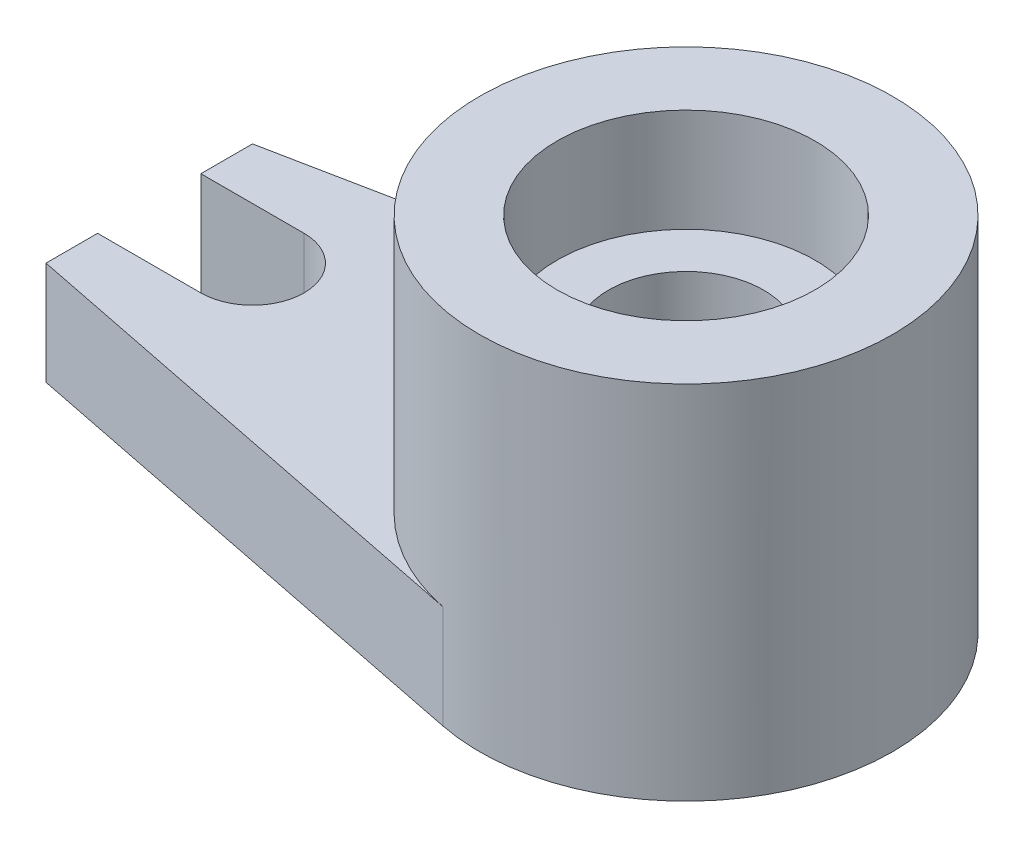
ISO-10303-21;
HEADER;
FILE_DESCRIPTION(('STEP AP214'),'2;1');
FILE_NAME('part.step','',(''),(''),'','','');
FILE_SCHEMA(('AUTOMOTIVE_DESIGN { 1 0 10303 214 1 1 1 1 }'));
ENDSEC;
DATA;
#1=APPLICATION_CONTEXT('core data for automotive mechanical design processes');
#2=APPLICATION_PROTOCOL_DEFINITION('international standard','automotive_design',2000,#1);
#3=PRODUCT_CONTEXT('',#1,'mechanical');
#4=PRODUCT('Part','Part','',(#3));
#5=PRODUCT_RELATED_PRODUCT_CATEGORY('part','',(#4));
#6=PRODUCT_DEFINITION_FORMATION('','',#4);
#7=PRODUCT_DEFINITION_CONTEXT('part definition',#1,'design');
#8=PRODUCT_DEFINITION('design','',#6,#7);
#9=PRODUCT_DEFINITION_SHAPE('','',#8);
#10=(LENGTH_UNIT() NAMED_UNIT(*) SI_UNIT(.MILLI.,.METRE.));
#11=(NAMED_UNIT(*) PLANE_ANGLE_UNIT() SI_UNIT($,.RADIAN.));
#12=(NAMED_UNIT(*) SI_UNIT($,.STERADIAN.) SOLID_ANGLE_UNIT());
#13=UNCERTAINTY_MEASURE_WITH_UNIT(LENGTH_MEASURE(1.E-05),#10,'distance_accuracy_value','');
#14=(GEOMETRIC_REPRESENTATION_CONTEXT(3) GLOBAL_UNCERTAINTY_ASSIGNED_CONTEXT((#13)) GLOBAL_UNIT_ASSIGNED_CONTEXT((#10,
#11,#12)) REPRESENTATION_CONTEXT('',''));
#15=CARTESIAN_POINT('',(0.,0.,0.));
#16=DIRECTION('',(0.,0.,1.));
#17=DIRECTION('',(1.,0.,0.));
#18=AXIS2_PLACEMENT_3D('',#15,#16,#17);
#19=CARTESIAN_POINT('',(0.,35.,0.));
#20=DIRECTION('',(0.,-1.,0.));
#21=DIRECTION('',(0.,0.,-1.));
#22=AXIS2_PLACEMENT_3D('',#19,#20,#21);
#23=CYLINDRICAL_SURFACE('',#22,12.5);
#24=CARTESIAN_POINT('',(0.,25.,0.));
#25=DIRECTION('',(0.,1.,0.));
#26=DIRECTION('',(0.,0.,1.));
#27=AXIS2_PLACEMENT_3D('',#24,#25,#26);
#28=CIRCLE('',#27,12.5);
#29=CARTESIAN_POINT('',(0.,25.,12.5));
#30=VERTEX_POINT('',#29);
#31=EDGE_CURVE('E11',#30,#30,#28,.T.);
#32=ORIENTED_EDGE('',*,*,#31,.F.);
#33=EDGE_LOOP('',(#32));
#34=FACE_BOUND('',#33,.T.);
#35=CARTESIAN_POINT('',(0.,35.,0.));
#36=DIRECTION('',(0.,1.,0.));
#37=DIRECTION('',(0.,0.,1.));
#38=AXIS2_PLACEMENT_3D('',#35,#36,#37);
#39=CIRCLE('',#38,12.5);
#40=CARTESIAN_POINT('',(0.,35.,12.5));
#41=VERTEX_POINT('',#40);
#42=EDGE_CURVE('E202',#41,#41,#39,.T.);
#43=ORIENTED_EDGE('',*,*,#42,.T.);
#44=EDGE_LOOP('',(#43));
#45=FACE_BOUND('',#44,.T.);
#46=ADVANCED_FACE('F41',(#34,#45),#23,.F.);
#47=CARTESIAN_POINT('',(0.,35.,0.));
#48=DIRECTION('',(0.,-1.,0.));
#49=DIRECTION('',(0.,0.,-1.));
#50=AXIS2_PLACEMENT_3D('',#47,#48,#49);
#51=CYLINDRICAL_SURFACE('',#50,20.);
#52=CARTESIAN_POINT('',(0.,10.,0.));
#53=DIRECTION('',(0.,1.,0.));
#54=DIRECTION('',(0.,0.,1.));
#55=AXIS2_PLACEMENT_3D('',#52,#53,#54);
#56=CIRCLE('',#55,20.);
#57=CARTESIAN_POINT('',(-3.92078440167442,10.,-19.6119211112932));
#58=VERTEX_POINT('',#57);
#59=CARTESIAN_POINT('',(-3.92078440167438,10.,19.6119211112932));
#60=VERTEX_POINT('',#59);
#61=EDGE_CURVE('E56',#58,#60,#56,.T.);
#62=ORIENTED_EDGE('',*,*,#61,.T.);
#63=DIRECTION('',(0.,-1.,0.));
#64=VECTOR('',#63,1.);
#65=CARTESIAN_POINT('',(-3.92078440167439,10.,19.6119211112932));
#66=LINE('',#65,#64);
#67=CARTESIAN_POINT('',(-3.92078440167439,0.,19.6119211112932));
#68=VERTEX_POINT('',#67);
#69=EDGE_CURVE('E185',#60,#68,#66,.T.);
#70=ORIENTED_EDGE('',*,*,#69,.T.);
#71=CARTESIAN_POINT('',(0.,0.,0.));
#72=DIRECTION('',(0.,1.,0.));
#73=DIRECTION('',(0.,0.,1.));
#74=AXIS2_PLACEMENT_3D('',#71,#72,#73);
#75=CIRCLE('',#74,20.);
#76=CARTESIAN_POINT('',(-3.92078440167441,0.,-19.6119211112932));
#77=VERTEX_POINT('',#76);
#78=EDGE_CURVE('E198',#68,#77,#75,.T.);
#79=ORIENTED_EDGE('',*,*,#78,.T.);
#80=DIRECTION('',(0.,-1.,0.));
#81=VECTOR('',#80,1.);
#82=CARTESIAN_POINT('',(-3.92078440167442,10.,-19.6119211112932));
#83=LINE('',#82,#81);
#84=EDGE_CURVE('E61',#58,#77,#83,.T.);
#85=ORIENTED_EDGE('',*,*,#84,.F.);
#86=EDGE_LOOP('',(#62,#70,#79,#85));
#87=FACE_BOUND('',#86,.T.);
#88=CARTESIAN_POINT('',(0.,35.,0.));
#89=DIRECTION('',(0.,1.,0.));
#90=DIRECTION('',(0.,0.,1.));
#91=AXIS2_PLACEMENT_3D('',#88,#89,#90);
#92=CIRCLE('',#91,20.);
#93=CARTESIAN_POINT('',(0.,35.,20.));
#94=VERTEX_POINT('',#93);
#95=EDGE_CURVE('E49',#94,#94,#92,.T.);
#96=ORIENTED_EDGE('',*,*,#95,.F.);
#97=EDGE_LOOP('',(#96));
#98=FACE_BOUND('',#97,.T.);
#99=ADVANCED_FACE('F209',(#87,#98),#51,.T.);
#100=CARTESIAN_POINT('',(0.,35.,0.));
#101=DIRECTION('',(0.,1.,0.));
#102=DIRECTION('',(0.,0.,1.));
#103=AXIS2_PLACEMENT_3D('',#100,#101,#102);
#104=PLANE('',#103);
#105=ORIENTED_EDGE('',*,*,#42,.F.);
#106=EDGE_LOOP('',(#105));
#107=FACE_BOUND('',#106,.T.);
#108=ORIENTED_EDGE('',*,*,#95,.T.);
#109=EDGE_LOOP('',(#108));
#110=FACE_BOUND('',#109,.T.);
#111=ADVANCED_FACE('F246',(#107,#110),#104,.T.);
#112=CARTESIAN_POINT('',(0.,0.,0.));
#113=DIRECTION('',(0.,1.,0.));
#114=DIRECTION('',(0.,0.,1.));
#115=AXIS2_PLACEMENT_3D('',#112,#113,#114);
#116=PLANE('',#115);
#117=ORIENTED_EDGE('',*,*,#78,.F.);
#118=DIRECTION('',(0.980596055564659,0.,0.196039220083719));
#119=VECTOR('',#118,1.);
#120=CARTESIAN_POINT('',(-3.92078440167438,0.,19.6119211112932));
#121=LINE('',#120,#119);
#122=CARTESIAN_POINT('',(-52.,0.,10.));
#123=VERTEX_POINT('',#122);
#124=EDGE_CURVE('E164',#123,#68,#121,.T.);
#125=ORIENTED_EDGE('',*,*,#124,.F.);
#126=DIRECTION('',(0.,0.,1.));
#127=VECTOR('',#126,1.);
#128=CARTESIAN_POINT('',(-52.,0.,0.));
#129=LINE('',#128,#127);
#130=CARTESIAN_POINT('',(-52.,0.,5.));
#131=VERTEX_POINT('',#130);
#132=EDGE_CURVE('E161',#131,#123,#129,.T.);
#133=ORIENTED_EDGE('',*,*,#132,.F.);
#134=DIRECTION('',(-1.,0.,0.));
#135=VECTOR('',#134,1.);
#136=CARTESIAN_POINT('',(0.,0.,4.99999999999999));
#137=LINE('',#136,#135);
#138=CARTESIAN_POINT('',(-42.,0.,5.));
#139=VERTEX_POINT('',#138);
#140=EDGE_CURVE('E158',#139,#131,#137,.T.);
#141=ORIENTED_EDGE('',*,*,#140,.F.);
#142=CARTESIAN_POINT('',(-42.,0.,0.));
#143=DIRECTION('',(0.,1.,0.));
#144=DIRECTION('',(0.,0.,1.));
#145=AXIS2_PLACEMENT_3D('',#142,#143,#144);
#146=CIRCLE('',#145,5.);
#147=CARTESIAN_POINT('',(-42.,0.,-5.));
#148=VERTEX_POINT('',#147);
#149=EDGE_CURVE('E113',#139,#148,#146,.T.);
#150=ORIENTED_EDGE('',*,*,#149,.T.);
#151=DIRECTION('',(-1.,0.,0.));
#152=VECTOR('',#151,1.);
#153=CARTESIAN_POINT('',(0.,0.,-4.99999999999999));
#154=LINE('',#153,#152);
#155=CARTESIAN_POINT('',(-52.,0.,-5.));
#156=VERTEX_POINT('',#155);
#157=EDGE_CURVE('E133',#148,#156,#154,.T.);
#158=ORIENTED_EDGE('',*,*,#157,.T.);
#159=DIRECTION('',(0.,0.,1.));
#160=VECTOR('',#159,1.);
#161=CARTESIAN_POINT('',(-52.,0.,0.));
#162=LINE('',#161,#160);
#163=CARTESIAN_POINT('',(-52.,0.,-9.99999999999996));
#164=VERTEX_POINT('',#163);
#165=EDGE_CURVE('E137',#164,#156,#162,.T.);
#166=ORIENTED_EDGE('',*,*,#165,.F.);
#167=DIRECTION('',(-0.980596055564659,0.,0.19603922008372));
#168=VECTOR('',#167,1.);
#169=CARTESIAN_POINT('',(-3.92078440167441,0.,-19.6119211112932));
#170=LINE('',#169,#168);
#171=EDGE_CURVE('E168',#77,#164,#170,.T.);
#172=ORIENTED_EDGE('',*,*,#171,.F.);
#173=EDGE_LOOP('',(#117,#125,#133,#141,#150,#158,#166,#172));
#174=FACE_BOUND('',#173,.T.);
#175=CARTESIAN_POINT('',(0.,0.,0.));
#176=DIRECTION('',(0.,1.,0.));
#177=DIRECTION('',(0.,0.,1.));
#178=AXIS2_PLACEMENT_3D('',#175,#176,#177);
#179=CIRCLE('',#178,7.5);
#180=CARTESIAN_POINT('',(0.,0.,7.5));
#181=VERTEX_POINT('',#180);
#182=EDGE_CURVE('E117',#181,#181,#179,.T.);
#183=ORIENTED_EDGE('',*,*,#182,.T.);
#184=EDGE_LOOP('',(#183));
#185=FACE_BOUND('',#184,.T.);
#186=ADVANCED_FACE('F219',(#174,#185),#116,.F.);
#187=CARTESIAN_POINT('',(0.,25.,0.));
#188=DIRECTION('',(0.,-1.,0.));
#189=DIRECTION('',(0.,0.,-1.));
#190=AXIS2_PLACEMENT_3D('',#187,#188,#189);
#191=CYLINDRICAL_SURFACE('',#190,7.5);
#192=CARTESIAN_POINT('',(0.,25.,0.));
#193=DIRECTION('',(0.,1.,0.));
#194=DIRECTION('',(0.,0.,1.));
#195=AXIS2_PLACEMENT_3D('',#192,#193,#194);
#196=CIRCLE('',#195,7.5);
#197=CARTESIAN_POINT('',(0.,25.,7.5));
#198=VERTEX_POINT('',#197);
#199=EDGE_CURVE('E194',#198,#198,#196,.T.);
#200=ORIENTED_EDGE('',*,*,#199,.T.);
#201=EDGE_LOOP('',(#200));
#202=FACE_BOUND('',#201,.T.);
#203=ORIENTED_EDGE('',*,*,#182,.F.);
#204=EDGE_LOOP('',(#203));
#205=FACE_BOUND('',#204,.T.);
#206=ADVANCED_FACE('F258',(#202,#205),#191,.F.);
#207=CARTESIAN_POINT('',(0.,25.,0.));
#208=DIRECTION('',(0.,1.,0.));
#209=DIRECTION('',(0.,0.,1.));
#210=AXIS2_PLACEMENT_3D('',#207,#208,#209);
#211=PLANE('',#210);
#212=ORIENTED_EDGE('',*,*,#199,.F.);
#213=EDGE_LOOP('',(#212));
#214=FACE_BOUND('',#213,.T.);
#215=ORIENTED_EDGE('',*,*,#31,.T.);
#216=EDGE_LOOP('',(#215));
#217=FACE_BOUND('',#216,.T.);
#218=ADVANCED_FACE('F263',(#214,#217),#211,.T.);
#219=CARTESIAN_POINT('',(-42.,10.,0.));
#220=DIRECTION('',(0.,-1.,0.));
#221=DIRECTION('',(0.,0.,-1.));
#222=AXIS2_PLACEMENT_3D('',#219,#220,#221);
#223=CYLINDRICAL_SURFACE('',#222,5.);
#224=ORIENTED_EDGE('',*,*,#149,.F.);
#225=DIRECTION('',(0.,-1.,0.));
#226=VECTOR('',#225,1.);
#227=CARTESIAN_POINT('',(-42.,10.,5.));
#228=LINE('',#227,#226);
#229=CARTESIAN_POINT('',(-42.,10.,5.));
#230=VERTEX_POINT('',#229);
#231=EDGE_CURVE('E106',#230,#139,#228,.T.);
#232=ORIENTED_EDGE('',*,*,#231,.F.);
#233=CARTESIAN_POINT('',(-42.,10.,0.));
#234=DIRECTION('',(0.,1.,0.));
#235=DIRECTION('',(0.,0.,1.));
#236=AXIS2_PLACEMENT_3D('',#233,#234,#235);
#237=CIRCLE('',#236,5.);
#238=CARTESIAN_POINT('',(-42.,10.,-5.));
#239=VERTEX_POINT('',#238);
#240=EDGE_CURVE('E110',#230,#239,#237,.T.);
#241=ORIENTED_EDGE('',*,*,#240,.T.);
#242=DIRECTION('',(0.,-1.,0.));
#243=VECTOR('',#242,1.);
#244=CARTESIAN_POINT('',(-42.,10.,-5.));
#245=LINE('',#244,#243);
#246=EDGE_CURVE('E155',#239,#148,#245,.T.);
#247=ORIENTED_EDGE('',*,*,#246,.T.);
#248=EDGE_LOOP('',(#224,#232,#241,#247));
#249=FACE_BOUND('',#248,.T.);
#250=ADVANCED_FACE('F108',(#249),#223,.F.);
#251=CARTESIAN_POINT('',(0.,10.,4.99999999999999));
#252=DIRECTION('',(0.,0.,1.));
#253=DIRECTION('',(1.,0.,0.));
#254=AXIS2_PLACEMENT_3D('',#251,#252,#253);
#255=PLANE('',#254);
#256=ORIENTED_EDGE('',*,*,#140,.T.);
#257=DIRECTION('',(0.,-1.,0.));
#258=VECTOR('',#257,1.);
#259=CARTESIAN_POINT('',(-52.,10.,5.));
#260=LINE('',#259,#258);
#261=CARTESIAN_POINT('',(-52.,10.,5.));
#262=VERTEX_POINT('',#261);
#263=EDGE_CURVE('E118',#262,#131,#260,.T.);
#264=ORIENTED_EDGE('',*,*,#263,.F.);
#265=DIRECTION('',(-1.,0.,0.));
#266=VECTOR('',#265,1.);
#267=CARTESIAN_POINT('',(0.,10.,4.99999999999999));
#268=LINE('',#267,#266);
#269=EDGE_CURVE('E121',#230,#262,#268,.T.);
#270=ORIENTED_EDGE('',*,*,#269,.F.);
#271=ORIENTED_EDGE('',*,*,#231,.T.);
#272=EDGE_LOOP('',(#256,#264,#270,#271));
#273=FACE_BOUND('',#272,.T.);
#274=ADVANCED_FACE('F122',(#273),#255,.F.);
#275=CARTESIAN_POINT('',(-52.,10.,0.));
#276=DIRECTION('',(1.,0.,0.));
#277=DIRECTION('',(0.,0.,-1.));
#278=AXIS2_PLACEMENT_3D('',#275,#276,#277);
#279=PLANE('',#278);
#280=ORIENTED_EDGE('',*,*,#132,.T.);
#281=DIRECTION('',(0.,-1.,0.));
#282=VECTOR('',#281,1.);
#283=CARTESIAN_POINT('',(-52.,10.,10.));
#284=LINE('',#283,#282);
#285=CARTESIAN_POINT('',(-52.,10.,10.));
#286=VERTEX_POINT('',#285);
#287=EDGE_CURVE('E188',#286,#123,#284,.T.);
#288=ORIENTED_EDGE('',*,*,#287,.F.);
#289=DIRECTION('',(0.,0.,1.));
#290=VECTOR('',#289,1.);
#291=CARTESIAN_POINT('',(-52.,10.,0.));
#292=LINE('',#291,#290);
#293=EDGE_CURVE('E127',#262,#286,#292,.T.);
#294=ORIENTED_EDGE('',*,*,#293,.F.);
#295=ORIENTED_EDGE('',*,*,#263,.T.);
#296=EDGE_LOOP('',(#280,#288,#294,#295));
#297=FACE_BOUND('',#296,.T.);
#298=ADVANCED_FACE('F232',(#297),#279,.F.);
#299=CARTESIAN_POINT('',(-3.92078440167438,10.,19.6119211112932));
#300=DIRECTION('',(0.196039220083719,0.,-0.980596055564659));
#301=DIRECTION('',(-0.980596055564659,0.,-0.196039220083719));
#302=AXIS2_PLACEMENT_3D('',#299,#300,#301);
#303=PLANE('',#302);
#304=ORIENTED_EDGE('',*,*,#124,.T.);
#305=ORIENTED_EDGE('',*,*,#69,.F.);
#306=DIRECTION('',(0.980596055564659,0.,0.196039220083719));
#307=VECTOR('',#306,1.);
#308=CARTESIAN_POINT('',(-3.92078440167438,10.,19.6119211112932));
#309=LINE('',#308,#307);
#310=EDGE_CURVE('E142',#286,#60,#309,.T.);
#311=ORIENTED_EDGE('',*,*,#310,.F.);
#312=ORIENTED_EDGE('',*,*,#287,.T.);
#313=EDGE_LOOP('',(#304,#305,#311,#312));
#314=FACE_BOUND('',#313,.T.);
#315=ADVANCED_FACE('F229',(#314),#303,.F.);
#316=CARTESIAN_POINT('',(-3.92078440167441,10.,-19.6119211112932));
#317=DIRECTION('',(0.19603922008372,0.,0.980596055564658));
#318=DIRECTION('',(0.980596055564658,0.,-0.19603922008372));
#319=AXIS2_PLACEMENT_3D('',#316,#317,#318);
#320=PLANE('',#319);
#321=ORIENTED_EDGE('',*,*,#171,.T.);
#322=DIRECTION('',(0.,-1.,0.));
#323=VECTOR('',#322,1.);
#324=CARTESIAN_POINT('',(-52.,10.,-9.99999999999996));
#325=LINE('',#324,#323);
#326=CARTESIAN_POINT('',(-52.,10.,-9.99999999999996));
#327=VERTEX_POINT('',#326);
#328=EDGE_CURVE('E179',#327,#164,#325,.T.);
#329=ORIENTED_EDGE('',*,*,#328,.F.);
#330=DIRECTION('',(-0.980596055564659,0.,0.19603922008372));
#331=VECTOR('',#330,1.);
#332=CARTESIAN_POINT('',(-3.92078440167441,10.,-19.6119211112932));
#333=LINE('',#332,#331);
#334=EDGE_CURVE('E147',#58,#327,#333,.T.);
#335=ORIENTED_EDGE('',*,*,#334,.F.);
#336=ORIENTED_EDGE('',*,*,#84,.T.);
#337=EDGE_LOOP('',(#321,#329,#335,#336));
#338=FACE_BOUND('',#337,.T.);
#339=ADVANCED_FACE('F216',(#338),#320,.F.);
#340=CARTESIAN_POINT('',(-52.,10.,0.));
#341=DIRECTION('',(1.,0.,0.));
#342=DIRECTION('',(0.,0.,-1.));
#343=AXIS2_PLACEMENT_3D('',#340,#341,#342);
#344=PLANE('',#343);
#345=ORIENTED_EDGE('',*,*,#165,.T.);
#346=DIRECTION('',(0.,-1.,0.));
#347=VECTOR('',#346,1.);
#348=CARTESIAN_POINT('',(-52.,10.,-5.));
#349=LINE('',#348,#347);
#350=CARTESIAN_POINT('',(-52.,10.,-5.));
#351=VERTEX_POINT('',#350);
#352=EDGE_CURVE('E176',#351,#156,#349,.T.);
#353=ORIENTED_EDGE('',*,*,#352,.F.);
#354=DIRECTION('',(0.,0.,1.));
#355=VECTOR('',#354,1.);
#356=CARTESIAN_POINT('',(-52.,10.,0.));
#357=LINE('',#356,#355);
#358=EDGE_CURVE('E150',#327,#351,#357,.T.);
#359=ORIENTED_EDGE('',*,*,#358,.F.);
#360=ORIENTED_EDGE('',*,*,#328,.T.);
#361=EDGE_LOOP('',(#345,#353,#359,#360));
#362=FACE_BOUND('',#361,.T.);
#363=ADVANCED_FACE('F224',(#362),#344,.F.);
#364=CARTESIAN_POINT('',(0.,10.,-4.99999999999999));
#365=DIRECTION('',(0.,0.,1.));
#366=DIRECTION('',(1.,0.,0.));
#367=AXIS2_PLACEMENT_3D('',#364,#365,#366);
#368=PLANE('',#367);
#369=ORIENTED_EDGE('',*,*,#157,.F.);
#370=ORIENTED_EDGE('',*,*,#246,.F.);
#371=DIRECTION('',(-1.,0.,0.));
#372=VECTOR('',#371,1.);
#373=CARTESIAN_POINT('',(0.,10.,-4.99999999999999));
#374=LINE('',#373,#372);
#375=EDGE_CURVE('E131',#239,#351,#374,.T.);
#376=ORIENTED_EDGE('',*,*,#375,.T.);
#377=ORIENTED_EDGE('',*,*,#352,.T.);
#378=EDGE_LOOP('',(#369,#370,#376,#377));
#379=FACE_BOUND('',#378,.T.);
#380=ADVANCED_FACE('F305',(#379),#368,.T.);
#381=CARTESIAN_POINT('',(0.,10.,0.));
#382=DIRECTION('',(0.,1.,0.));
#383=DIRECTION('',(0.,0.,1.));
#384=AXIS2_PLACEMENT_3D('',#381,#382,#383);
#385=PLANE('',#384);
#386=ORIENTED_EDGE('',*,*,#240,.F.);
#387=ORIENTED_EDGE('',*,*,#269,.T.);
#388=ORIENTED_EDGE('',*,*,#293,.T.);
#389=ORIENTED_EDGE('',*,*,#310,.T.);
#390=ORIENTED_EDGE('',*,*,#61,.F.);
#391=ORIENTED_EDGE('',*,*,#334,.T.);
#392=ORIENTED_EDGE('',*,*,#358,.T.);
#393=ORIENTED_EDGE('',*,*,#375,.F.);
#394=EDGE_LOOP('',(#386,#387,#388,#389,#390,#391,#392,#393));
#395=FACE_BOUND('',#394,.T.);
#396=ADVANCED_FACE('F129',(#395),#385,.T.);
#397=CLOSED_SHELL('',(#46,#99,#111,#186,#206,#218,#250,#274,#298,#315,#339,#363,#380,#396));
#398=MANIFOLD_SOLID_BREP('B2',#397);
#399=ADVANCED_BREP_SHAPE_REPRESENTATION('',(#18,#398),#14);
#400=SHAPE_DEFINITION_REPRESENTATION(#9,#399);
ENDSEC;
END-ISO-10303-21;
